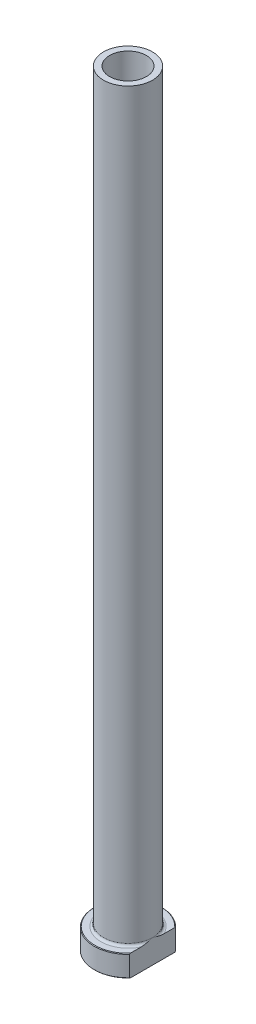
ISO-10303-21;
HEADER;
FILE_DESCRIPTION(('STEP AP214'),'2;1');
FILE_NAME('part.step','',(''),(''),'','','');
FILE_SCHEMA(('AUTOMOTIVE_DESIGN { 1 0 10303 214 1 1 1 1 }'));
ENDSEC;
DATA;
#1=APPLICATION_CONTEXT('core data for automotive mechanical design processes');
#2=APPLICATION_PROTOCOL_DEFINITION('international standard','automotive_design',2000,#1);
#3=PRODUCT_CONTEXT('',#1,'mechanical');
#4=PRODUCT('Part','Part','',(#3));
#5=PRODUCT_RELATED_PRODUCT_CATEGORY('part','',(#4));
#6=PRODUCT_DEFINITION_FORMATION('','',#4);
#7=PRODUCT_DEFINITION_CONTEXT('part definition',#1,'design');
#8=PRODUCT_DEFINITION('design','',#6,#7);
#9=PRODUCT_DEFINITION_SHAPE('','',#8);
#10=(LENGTH_UNIT() NAMED_UNIT(*) SI_UNIT(.MILLI.,.METRE.));
#11=(NAMED_UNIT(*) PLANE_ANGLE_UNIT() SI_UNIT($,.RADIAN.));
#12=(NAMED_UNIT(*) SI_UNIT($,.STERADIAN.) SOLID_ANGLE_UNIT());
#13=UNCERTAINTY_MEASURE_WITH_UNIT(LENGTH_MEASURE(1.E-05),#10,'distance_accuracy_value','');
#14=(GEOMETRIC_REPRESENTATION_CONTEXT(3) GLOBAL_UNCERTAINTY_ASSIGNED_CONTEXT((#13)) GLOBAL_UNIT_ASSIGNED_CONTEXT((#10,
#11,#12)) REPRESENTATION_CONTEXT('',''));
#15=CARTESIAN_POINT('',(0.,0.,0.));
#16=DIRECTION('',(0.,0.,1.));
#17=DIRECTION('',(1.,0.,0.));
#18=AXIS2_PLACEMENT_3D('',#15,#16,#17);
#19=CARTESIAN_POINT('',(0.,92.1876809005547,0.));
#20=DIRECTION('',(0.,1.,0.));
#21=DIRECTION('',(0.,0.,1.));
#22=AXIS2_PLACEMENT_3D('',#19,#20,#21);
#23=CYLINDRICAL_SURFACE('',#22,6.00000000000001);
#24=CARTESIAN_POINT('',(0.,250.,0.));
#25=DIRECTION('',(0.,1.,0.));
#26=DIRECTION('',(0.,0.,1.));
#27=AXIS2_PLACEMENT_3D('',#24,#25,#26);
#28=CIRCLE('',#27,6.00000000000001);
#29=CARTESIAN_POINT('',(0.,250.,6.00000000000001));
#30=VERTEX_POINT('',#29);
#31=EDGE_CURVE('E167',#30,#30,#28,.T.);
#32=ORIENTED_EDGE('',*,*,#31,.T.);
#33=EDGE_LOOP('',(#32));
#34=FACE_BOUND('',#33,.T.);
#35=CARTESIAN_POINT('',(0.,195.,0.));
#36=DIRECTION('',(0.,1.,0.));
#37=DIRECTION('',(0.,0.,1.));
#38=AXIS2_PLACEMENT_3D('',#35,#36,#37);
#39=CIRCLE('',#38,6.00000000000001);
#40=CARTESIAN_POINT('',(0.,195.,6.00000000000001));
#41=VERTEX_POINT('',#40);
#42=EDGE_CURVE('E170',#41,#41,#39,.T.);
#43=ORIENTED_EDGE('',*,*,#42,.F.);
#44=EDGE_LOOP('',(#43));
#45=FACE_BOUND('',#44,.T.);
#46=ADVANCED_FACE('F32',(#34,#45),#23,.F.);
#47=CARTESIAN_POINT('',(-6.00000000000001,250.,0.));
#48=DIRECTION('',(0.,1.,0.));
#49=DIRECTION('',(0.,0.,1.));
#50=AXIS2_PLACEMENT_3D('',#47,#48,#49);
#51=PLANE('',#50);
#52=CARTESIAN_POINT('',(0.,250.,0.));
#53=DIRECTION('',(0.,1.,0.));
#54=DIRECTION('',(0.,0.,1.));
#55=AXIS2_PLACEMENT_3D('',#52,#53,#54);
#56=CIRCLE('',#55,8.00000000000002);
#57=CARTESIAN_POINT('',(0.,250.,8.00000000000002));
#58=VERTEX_POINT('',#57);
#59=EDGE_CURVE('E174',#58,#58,#56,.T.);
#60=ORIENTED_EDGE('',*,*,#59,.T.);
#61=EDGE_LOOP('',(#60));
#62=FACE_BOUND('',#61,.T.);
#63=ORIENTED_EDGE('',*,*,#31,.F.);
#64=EDGE_LOOP('',(#63));
#65=FACE_BOUND('',#64,.T.);
#66=ADVANCED_FACE('F157',(#62,#65),#51,.T.);
#67=CARTESIAN_POINT('',(0.,92.1876809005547,0.));
#68=DIRECTION('',(0.,1.,0.));
#69=DIRECTION('',(0.,0.,1.));
#70=AXIS2_PLACEMENT_3D('',#67,#68,#69);
#71=CYLINDRICAL_SURFACE('',#70,8.);
#72=CARTESIAN_POINT('',(0.,7.8,0.));
#73=DIRECTION('',(0.,1.,0.));
#74=DIRECTION('',(0.,0.,1.));
#75=AXIS2_PLACEMENT_3D('',#72,#73,#74);
#76=CIRCLE('',#75,8.);
#77=CARTESIAN_POINT('',(8.,7.8,0.));
#78=VERTEX_POINT('',#77);
#79=EDGE_CURVE('E180',#78,#78,#76,.T.);
#80=ORIENTED_EDGE('',*,*,#79,.T.);
#81=EDGE_LOOP('',(#80));
#82=FACE_BOUND('',#81,.T.);
#83=ORIENTED_EDGE('',*,*,#59,.F.);
#84=EDGE_LOOP('',(#83));
#85=FACE_BOUND('',#84,.T.);
#86=ADVANCED_FACE('F162',(#82,#85),#71,.T.);
#87=CARTESIAN_POINT('',(-7.99999999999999,7.,0.));
#88=DIRECTION('',(0.,1.,0.));
#89=DIRECTION('',(0.,0.,1.));
#90=AXIS2_PLACEMENT_3D('',#87,#88,#89);
#91=PLANE('',#90);
#92=DIRECTION('',(0.,0.,1.));
#93=VECTOR('',#92,1.);
#94=CARTESIAN_POINT('',(8.,7.,0.));
#95=LINE('',#94,#93);
#96=CARTESIAN_POINT('',(8.,7.,-7.25534285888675));
#97=VERTEX_POINT('',#96);
#98=CARTESIAN_POINT('',(8.,7.,-3.66606055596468));
#99=VERTEX_POINT('',#98);
#100=EDGE_CURVE('E54',#97,#99,#95,.T.);
#101=ORIENTED_EDGE('',*,*,#100,.F.);
#102=CARTESIAN_POINT('',(0.,7.,0.));
#103=DIRECTION('',(0.,1.,0.));
#104=DIRECTION('',(0.,0.,1.));
#105=AXIS2_PLACEMENT_3D('',#102,#103,#104);
#106=CIRCLE('',#105,10.8);
#107=CARTESIAN_POINT('',(8.,7.,7.25534285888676));
#108=VERTEX_POINT('',#107);
#109=EDGE_CURVE('E186',#97,#108,#106,.T.);
#110=ORIENTED_EDGE('',*,*,#109,.T.);
#111=CARTESIAN_POINT('',(8.,7.,3.66606055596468));
#112=VERTEX_POINT('',#111);
#113=EDGE_CURVE('E134',#112,#108,#95,.T.);
#114=ORIENTED_EDGE('',*,*,#113,.F.);
#115=CARTESIAN_POINT('',(0.,7.,0.));
#116=DIRECTION('',(0.,1.,0.));
#117=DIRECTION('',(0.,0.,1.));
#118=AXIS2_PLACEMENT_3D('',#115,#116,#117);
#119=CIRCLE('',#118,8.8);
#120=EDGE_CURVE('E183',#112,#99,#119,.F.);
#121=ORIENTED_EDGE('',*,*,#120,.T.);
#122=EDGE_LOOP('',(#101,#110,#114,#121));
#123=FACE_BOUND('',#122,.T.);
#124=ADVANCED_FACE('F197',(#123),#91,.T.);
#125=CARTESIAN_POINT('',(0.,92.1876809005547,0.));
#126=DIRECTION('',(0.,1.,0.));
#127=DIRECTION('',(0.,0.,1.));
#128=AXIS2_PLACEMENT_3D('',#125,#126,#127);
#129=CYLINDRICAL_SURFACE('',#128,11.);
#130=DIRECTION('',(0.,-1.,0.));
#131=VECTOR('',#130,1.);
#132=CARTESIAN_POINT('',(8.,250.,7.54983443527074));
#133=LINE('',#132,#131);
#134=CARTESIAN_POINT('',(8.,6.79999999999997,7.54983443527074));
#135=VERTEX_POINT('',#134);
#136=CARTESIAN_POINT('',(8.,0.200000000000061,7.54983443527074));
#137=VERTEX_POINT('',#136);
#138=EDGE_CURVE('E82',#135,#137,#133,.T.);
#139=ORIENTED_EDGE('',*,*,#138,.F.);
#140=CARTESIAN_POINT('',(0.,6.79999999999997,0.));
#141=DIRECTION('',(0.,1.,0.));
#142=DIRECTION('',(0.,0.,1.));
#143=AXIS2_PLACEMENT_3D('',#140,#141,#142);
#144=CIRCLE('',#143,11.);
#145=CARTESIAN_POINT('',(8.,6.79999999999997,-7.54983443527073));
#146=VERTEX_POINT('',#145);
#147=EDGE_CURVE('E95',#135,#146,#144,.F.);
#148=ORIENTED_EDGE('',*,*,#147,.T.);
#149=DIRECTION('',(0.,-1.,0.));
#150=VECTOR('',#149,1.);
#151=CARTESIAN_POINT('',(8.,250.,-7.54983443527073));
#152=LINE('',#151,#150);
#153=CARTESIAN_POINT('',(8.,0.200000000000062,-7.54983443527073));
#154=VERTEX_POINT('',#153);
#155=EDGE_CURVE('E192',#146,#154,#152,.T.);
#156=ORIENTED_EDGE('',*,*,#155,.T.);
#157=CARTESIAN_POINT('',(0.,0.200000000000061,0.));
#158=DIRECTION('',(0.,-1.,0.));
#159=DIRECTION('',(0.,0.,-1.));
#160=AXIS2_PLACEMENT_3D('',#157,#158,#159);
#161=CIRCLE('',#160,11.);
#162=EDGE_CURVE('E98',#154,#137,#161,.F.);
#163=ORIENTED_EDGE('',*,*,#162,.T.);
#164=EDGE_LOOP('',(#139,#148,#156,#163));
#165=FACE_BOUND('',#164,.T.);
#166=ADVANCED_FACE('F190',(#165),#129,.T.);
#167=CARTESIAN_POINT('',(-11.,0.,0.));
#168=DIRECTION('',(0.,-1.,0.));
#169=DIRECTION('',(0.,0.,-1.));
#170=AXIS2_PLACEMENT_3D('',#167,#168,#169);
#171=PLANE('',#170);
#172=CARTESIAN_POINT('',(0.,0.,0.));
#173=DIRECTION('',(0.,-1.,0.));
#174=DIRECTION('',(0.,0.,-1.));
#175=AXIS2_PLACEMENT_3D('',#172,#173,#174);
#176=CIRCLE('',#175,6.74999999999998);
#177=CARTESIAN_POINT('',(0.,0.,-6.74999999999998));
#178=VERTEX_POINT('',#177);
#179=EDGE_CURVE('E40',#178,#178,#176,.F.);
#180=ORIENTED_EDGE('',*,*,#179,.T.);
#181=EDGE_LOOP('',(#180));
#182=FACE_BOUND('',#181,.T.);
#183=DIRECTION('',(0.,0.,-1.));
#184=VECTOR('',#183,1.);
#185=CARTESIAN_POINT('',(8.,0.,7.54983443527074));
#186=LINE('',#185,#184);
#187=CARTESIAN_POINT('',(8.,0.,7.25534285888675));
#188=VERTEX_POINT('',#187);
#189=CARTESIAN_POINT('',(8.,0.,-7.25534285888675));
#190=VERTEX_POINT('',#189);
#191=EDGE_CURVE('E47',#188,#190,#186,.T.);
#192=ORIENTED_EDGE('',*,*,#191,.F.);
#193=CARTESIAN_POINT('',(0.,0.,0.));
#194=DIRECTION('',(0.,-1.,0.));
#195=DIRECTION('',(0.,0.,-1.));
#196=AXIS2_PLACEMENT_3D('',#193,#194,#195);
#197=CIRCLE('',#196,10.7999999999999);
#198=EDGE_CURVE('E92',#188,#190,#197,.T.);
#199=ORIENTED_EDGE('',*,*,#198,.T.);
#200=EDGE_LOOP('',(#192,#199));
#201=FACE_BOUND('',#200,.T.);
#202=ADVANCED_FACE('F91',(#182,#201),#171,.T.);
#203=CARTESIAN_POINT('',(0.,92.1876809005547,0.));
#204=DIRECTION('',(0.,1.,0.));
#205=DIRECTION('',(0.,0.,1.));
#206=AXIS2_PLACEMENT_3D('',#203,#204,#205);
#207=CYLINDRICAL_SURFACE('',#206,6.25);
#208=CARTESIAN_POINT('',(0.,0.499999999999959,0.));
#209=DIRECTION('',(0.,-1.,0.));
#210=DIRECTION('',(0.,0.,-1.));
#211=AXIS2_PLACEMENT_3D('',#208,#209,#210);
#212=CIRCLE('',#211,6.25);
#213=CARTESIAN_POINT('',(0.,0.499999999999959,-6.25));
#214=VERTEX_POINT('',#213);
#215=EDGE_CURVE('E11',#214,#214,#212,.T.);
#216=ORIENTED_EDGE('',*,*,#215,.T.);
#217=EDGE_LOOP('',(#216));
#218=FACE_BOUND('',#217,.T.);
#219=CARTESIAN_POINT('',(0.,183.,0.));
#220=DIRECTION('',(0.,1.,0.));
#221=DIRECTION('',(0.,0.,1.));
#222=AXIS2_PLACEMENT_3D('',#219,#220,#221);
#223=CIRCLE('',#222,6.25000000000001);
#224=CARTESIAN_POINT('',(0.,183.,6.25000000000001));
#225=VERTEX_POINT('',#224);
#226=EDGE_CURVE('E172',#225,#225,#223,.T.);
#227=ORIENTED_EDGE('',*,*,#226,.T.);
#228=EDGE_LOOP('',(#227));
#229=FACE_BOUND('',#228,.T.);
#230=ADVANCED_FACE('F215',(#218,#229),#207,.F.);
#231=CARTESIAN_POINT('',(0.,183.,0.));
#232=DIRECTION('',(0.,-1.,0.));
#233=DIRECTION('',(0.,0.,-1.));
#234=AXIS2_PLACEMENT_3D('',#231,#232,#233);
#235=CONICAL_SURFACE('',#234,6.25000000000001,0.0208303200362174);
#236=ORIENTED_EDGE('',*,*,#42,.T.);
#237=EDGE_LOOP('',(#236));
#238=FACE_BOUND('',#237,.T.);
#239=ORIENTED_EDGE('',*,*,#226,.F.);
#240=EDGE_LOOP('',(#239));
#241=FACE_BOUND('',#240,.T.);
#242=ADVANCED_FACE('F111',(#238,#241),#235,.F.);
#243=CARTESIAN_POINT('',(0.,7.8,0.));
#244=DIRECTION('',(0.,1.,0.));
#245=DIRECTION('',(0.,0.,1.));
#246=AXIS2_PLACEMENT_3D('',#243,#244,#245);
#247=TOROIDAL_SURFACE('',#246,8.8,0.8);
#248=ORIENTED_EDGE('',*,*,#120,.F.);
#249=CARTESIAN_POINT('',(8.,7.8,0.));
#250=CARTESIAN_POINT('',(8.,7.80000101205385,-1.09663887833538E-10));
#251=CARTESIAN_POINT('',(8.,7.80000202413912,2.93324122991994E-07));
#252=CARTESIAN_POINT('',(8.,7.80000394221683,1.16283100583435E-06));
#253=CARTESIAN_POINT('',(8.,7.80000483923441,1.75365147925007E-06));
#254=CARTESIAN_POINT('',(8.,7.80000665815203,3.16446795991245E-06));
#255=CARTESIAN_POINT('',(8.,7.80000756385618,4.00549183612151E-06));
#256=CARTESIAN_POINT('',(8.,7.80000923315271,5.78347948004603E-06));
#257=CARTESIAN_POINT('',(8.,7.8000099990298,6.71842053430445E-06));
#258=CARTESIAN_POINT('',(8.,7.80001270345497,1.02037220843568E-05));
#259=CARTESIAN_POINT('',(8.,7.80001449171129,1.28740408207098E-05));
#260=CARTESIAN_POINT('',(8.,7.80001755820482,1.82727392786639E-05));
#261=CARTESIAN_POINT('',(8.,7.8000188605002,2.09881564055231E-05));
#262=CARTESIAN_POINT('',(8.,7.80002405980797,3.2064781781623E-05));
#263=CARTESIAN_POINT('',(8.,7.8000277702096,4.05225605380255E-05));
#264=CARTESIAN_POINT('',(8.,7.80003348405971,5.68037726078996E-05));
#265=CARTESIAN_POINT('',(8.,7.80003564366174,6.45728891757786E-05));
#266=CARTESIAN_POINT('',(8.,7.8000509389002,0.000121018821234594));
#267=CARTESIAN_POINT('',(8.,7.80006211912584,0.000170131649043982));
#268=CARTESIAN_POINT('',(8.,7.80011099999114,0.000362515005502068));
#269=CARTESIAN_POINT('',(8.,7.80015802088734,0.000503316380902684));
#270=CARTESIAN_POINT('',(8.,7.80033939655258,0.00105711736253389));
#271=CARTESIAN_POINT('',(8.,7.80046737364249,0.0014716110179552));
#272=CARTESIAN_POINT('',(8.,7.80097644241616,0.00310648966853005));
#273=CARTESIAN_POINT('',(8.,7.80136531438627,0.00432501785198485));
#274=CARTESIAN_POINT('',(8.,7.80297358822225,0.0093795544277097));
#275=CARTESIAN_POINT('',(8.,7.80418342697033,0.0132178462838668));
#276=CARTESIAN_POINT('',(7.99999999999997,7.82754122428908,0.0873020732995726));
#277=CARTESIAN_POINT('',(7.99999999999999,7.84979021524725,0.157524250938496));
#278=CARTESIAN_POINT('',(8.00000000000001,7.89322681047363,0.295235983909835));
#279=CARTESIAN_POINT('',(8.,7.91442151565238,0.362723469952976));
#280=CARTESIAN_POINT('',(8.,7.95923432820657,0.506178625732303));
#281=CARTESIAN_POINT('',(8.,7.98282525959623,0.58215493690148));
#282=CARTESIAN_POINT('',(8.,8.02983069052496,0.735069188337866));
#283=CARTESIAN_POINT('',(8.,8.05324046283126,0.812008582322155));
#284=CARTESIAN_POINT('',(8.,8.09303795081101,0.944645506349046));
#285=CARTESIAN_POINT('',(8.,8.10956807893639,1.00030022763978));
#286=CARTESIAN_POINT('',(8.,8.14221289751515,1.11157683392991));
#287=CARTESIAN_POINT('',(8.,8.15832854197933,1.16719843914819));
#288=CARTESIAN_POINT('',(8.,8.20527739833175,1.33164052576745));
#289=CARTESIAN_POINT('',(8.,8.23549814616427,1.44063711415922));
#290=CARTESIAN_POINT('',(8.,8.29826335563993,1.67606835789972));
#291=CARTESIAN_POINT('',(8.,8.33044741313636,1.80259995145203));
#292=CARTESIAN_POINT('',(8.,8.39126396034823,2.05750030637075));
#293=CARTESIAN_POINT('',(8.,8.41986879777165,2.18587573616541));
#294=CARTESIAN_POINT('',(8.,8.47414203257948,2.45321874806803));
#295=CARTESIAN_POINT('',(8.,8.49943375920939,2.59226394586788));
#296=CARTESIAN_POINT('',(8.,8.54278750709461,2.87150561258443));
#297=CARTESIAN_POINT('',(8.,8.56085024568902,3.01170196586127));
#298=CARTESIAN_POINT('',(8.,8.58291287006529,3.24319459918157));
#299=CARTESIAN_POINT('',(8.,8.58962750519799,3.33423069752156));
#300=CARTESIAN_POINT('',(8.,8.59844042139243,3.51651109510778));
#301=CARTESIAN_POINT('',(8.,8.60054027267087,3.60775531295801));
#302=CARTESIAN_POINT('',(8.,8.59923478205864,3.78855451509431));
#303=CARTESIAN_POINT('',(8.,8.59592927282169,3.87810991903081));
#304=CARTESIAN_POINT('',(8.,8.58288784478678,4.05671727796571));
#305=CARTESIAN_POINT('',(8.,8.5731571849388,4.14576958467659));
#306=CARTESIAN_POINT('',(8.,8.54786053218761,4.30910044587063));
#307=CARTESIAN_POINT('',(8.,8.53341905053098,4.38354919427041));
#308=CARTESIAN_POINT('',(8.,8.4974754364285,4.53120906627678));
#309=CARTESIAN_POINT('',(8.,8.47593618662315,4.60441150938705));
#310=CARTESIAN_POINT('',(8.,8.42376924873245,4.74853436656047));
#311=CARTESIAN_POINT('',(8.,8.39303920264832,4.8194185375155));
#312=CARTESIAN_POINT('',(8.,8.32008168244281,4.95490582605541));
#313=CARTESIAN_POINT('',(8.,8.27792970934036,5.01954653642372));
#314=CARTESIAN_POINT('',(8.,8.20692535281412,5.10354772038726));
#315=CARTESIAN_POINT('',(8.,8.1839783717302,5.12788591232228));
#316=CARTESIAN_POINT('',(8.,8.13503511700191,5.17336988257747));
#317=CARTESIAN_POINT('',(8.,8.10903727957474,5.19451401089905));
#318=CARTESIAN_POINT('',(8.,8.05362521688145,5.23266411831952));
#319=CARTESIAN_POINT('',(8.,8.02417247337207,5.2496152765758));
#320=CARTESIAN_POINT('',(8.,7.96255238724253,5.27751973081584));
#321=CARTESIAN_POINT('',(8.,7.93039220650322,5.28848831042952));
#322=CARTESIAN_POINT('',(8.,7.87282733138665,5.30129051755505));
#323=CARTESIAN_POINT('',(8.,7.84777777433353,5.30473535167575));
#324=CARTESIAN_POINT('',(8.,7.7974579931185,5.30730687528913));
#325=CARTESIAN_POINT('',(8.,7.77218785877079,5.30643524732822));
#326=CARTESIAN_POINT('',(8.,7.72220872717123,5.30045124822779));
#327=CARTESIAN_POINT('',(8.,7.69749884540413,5.29534612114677));
#328=CARTESIAN_POINT('',(8.,7.64919855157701,5.28130622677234));
#329=CARTESIAN_POINT('',(8.,7.62560888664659,5.27236894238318));
#330=CARTESIAN_POINT('',(8.,7.57186978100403,5.24749103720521));
#331=CARTESIAN_POINT('',(8.,7.54235117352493,5.23019143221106));
#332=CARTESIAN_POINT('',(8.,7.48647501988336,5.1910787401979));
#333=CARTESIAN_POINT('',(8.,7.46012476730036,5.16925554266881));
#334=CARTESIAN_POINT('',(8.,7.39758131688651,5.11005232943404));
#335=CARTESIAN_POINT('',(8.,7.36345256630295,5.07050732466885));
#336=CARTESIAN_POINT('',(8.,7.30158414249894,4.9868053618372));
#337=CARTESIAN_POINT('',(8.,7.27385227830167,4.9426428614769));
#338=CARTESIAN_POINT('',(8.,7.22655631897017,4.85651446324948));
#339=CARTESIAN_POINT('',(8.,7.20642608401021,4.81485346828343));
#340=CARTESIAN_POINT('',(8.,7.16979237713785,4.72995016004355));
#341=CARTESIAN_POINT('',(8.,7.15329194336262,4.6867065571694));
#342=CARTESIAN_POINT('',(8.,7.10824755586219,4.55471342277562));
#343=CARTESIAN_POINT('',(8.,7.08448205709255,4.46433285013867));
#344=CARTESIAN_POINT('',(8.,7.04606817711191,4.27884520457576));
#345=CARTESIAN_POINT('',(8.,7.03172934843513,4.18367881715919));
#346=CARTESIAN_POINT('',(8.,7.01115182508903,3.99231790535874));
#347=CARTESIAN_POINT('',(8.,7.004929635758,3.89612168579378));
#348=CARTESIAN_POINT('',(8.,6.99917472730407,3.70683203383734));
#349=CARTESIAN_POINT('',(8.,6.99942213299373,3.61374410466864));
#350=CARTESIAN_POINT('',(8.,7.00500334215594,3.42814181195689));
#351=CARTESIAN_POINT('',(8.,7.01031504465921,3.33562671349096));
#352=CARTESIAN_POINT('',(8.,7.027292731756,3.12465235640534));
#353=CARTESIAN_POINT('',(8.,7.04033732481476,3.00630616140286));
#354=CARTESIAN_POINT('',(8.,7.0720601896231,2.77043320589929));
#355=CARTESIAN_POINT('',(8.,7.09073668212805,2.65290619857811));
#356=CARTESIAN_POINT('',(8.,7.13314336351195,2.41598317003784));
#357=CARTESIAN_POINT('',(8.,7.15698005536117,2.29660645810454));
#358=CARTESIAN_POINT('',(8.,7.20856500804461,2.05839418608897));
#359=CARTESIAN_POINT('',(8.,7.23632304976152,1.9395607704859));
#360=CARTESIAN_POINT('',(8.,7.30538420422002,1.66026758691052));
#361=CARTESIAN_POINT('',(8.,7.34797978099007,1.50012949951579));
#362=CARTESIAN_POINT('',(8.,7.43661699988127,1.18271330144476));
#363=CARTESIAN_POINT('',(8.,7.48261587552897,1.02542306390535));
#364=CARTESIAN_POINT('',(8.,7.55073856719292,0.798945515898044));
#365=CARTESIAN_POINT('',(8.,7.57189590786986,0.729464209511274));
#366=CARTESIAN_POINT('',(8.,7.61466169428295,0.590318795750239));
#367=CARTESIAN_POINT('',(8.,7.63627166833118,0.520655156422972));
#368=CARTESIAN_POINT('',(8.,7.68075896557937,0.37807296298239));
#369=CARTESIAN_POINT('',(8.00000000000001,7.70364749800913,0.305157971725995));
#370=CARTESIAN_POINT('',(7.99999999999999,7.74926260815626,0.160522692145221));
#371=CARTESIAN_POINT('',(7.99999999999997,7.77198614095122,0.0888015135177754));
#372=CARTESIAN_POINT('',(8.,7.79581756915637,0.0132146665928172));
#373=CARTESIAN_POINT('',(8.,7.79702841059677,0.00937319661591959));
#374=CARTESIAN_POINT('',(8.,7.79863692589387,0.00431792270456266));
#375=CARTESIAN_POINT('',(8.,7.79902501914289,0.0031018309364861));
#376=CARTESIAN_POINT('',(8.,7.79953313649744,0.00147000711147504));
#377=CARTESIAN_POINT('',(8.,7.79966092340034,0.00105612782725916));
#378=CARTESIAN_POINT('',(8.,7.79984206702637,0.000503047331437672));
#379=CARTESIAN_POINT('',(8.,7.79988905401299,0.00036235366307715));
#380=CARTESIAN_POINT('',(8.,7.79993790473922,0.000170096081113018));
#381=CARTESIAN_POINT('',(8.,7.79994908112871,0.000120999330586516));
#382=CARTESIAN_POINT('',(8.,7.79996436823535,6.45695843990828E-05));
#383=CARTESIAN_POINT('',(8.,7.79996652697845,5.68014515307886E-05));
#384=CARTESIAN_POINT('',(8.,7.79997223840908,4.05221734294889E-05));
#385=CARTESIAN_POINT('',(8.,7.79997594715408,3.20652948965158E-05));
#386=CARTESIAN_POINT('',(8.,7.79998114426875,2.09895718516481E-05));
#387=CARTESIAN_POINT('',(8.,7.7999824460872,1.82742281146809E-05));
#388=CARTESIAN_POINT('',(8.,7.79998551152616,1.2875590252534E-05));
#389=CARTESIAN_POINT('',(8.,7.79998729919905,1.02052512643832E-05));
#390=CARTESIAN_POINT('',(8.,7.79999000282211,6.71981951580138E-06));
#391=CARTESIAN_POINT('',(8.,7.79999076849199,5.78481878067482E-06));
#392=CARTESIAN_POINT('',(8.,7.79999243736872,4.00667444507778E-06));
#393=CARTESIAN_POINT('',(8.,7.79999334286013,3.16555273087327E-06));
#394=CARTESIAN_POINT('',(8.,7.79999516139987,1.75450266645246E-06));
#395=CARTESIAN_POINT('',(8.,7.7999960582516,1.16355341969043E-06));
#396=CARTESIAN_POINT('',(8.,7.79999797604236,2.93728367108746E-07));
#397=CARTESIAN_POINT('',(8.,7.79999898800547,1.09661137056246E-10));
#398=CARTESIAN_POINT('',(8.,7.8,0.));
#399=B_SPLINE_CURVE_WITH_KNOTS('',3,(#249,#250,#251,#252,#253,#254,#255,#256,#257,#258,#259,
#260,#261,#262,#263,#264,#265,#266,#267,#268,#269,#270,#271,#272,#273,#274,#275,#276,#277,#278,
#279,#280,#281,#282,#283,#284,#285,#286,#287,#288,#289,#290,#291,#292,#293,#294,#295,#296,#297,
#298,#299,#300,#301,#302,#303,#304,#305,#306,#307,#308,#309,#310,#311,#312,#313,#314,#315,#316,
#317,#318,#319,#320,#321,#322,#323,#324,#325,#326,#327,#328,#329,#330,#331,#332,#333,#334,#335,
#336,#337,#338,#339,#340,#341,#342,#343,#344,#345,#346,#347,#348,#349,#350,#351,#352,#353,#354,
#355,#356,#357,#358,#359,#360,#361,#362,#363,#364,#365,#366,#367,#368,#369,#370,#371,#372,#373,
#374,#375,#376,#377,#378,#379,#380,#381,#382,#383,#384,#385,#386,#387,#388,#389,#390,#391,#392,
#393,#394,#395,#396,#397,#398),.UNSPECIFIED.,.T.,.F.,(4,2,2,2,2,2,2,2,2,2,2,2,2,2,2,2,2,2,2,2,2,
2,2,2,2,2,2,2,2,2,2,2,2,2,2,2,2,2,2,2,2,2,2,2,2,2,2,2,2,2,2,2,2,2,2,2,2,2,2,2,2,2,2,2,2,2,2,2,2,
2,2,2,2,2,4),(0.,3.04287455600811E-06,6.25419973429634E-06,9.94386247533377E-06,
1.35664308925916E-05,2.31665004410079E-05,3.21939784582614E-05,5.98353369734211E-05,
8.3994464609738E-05,0.000235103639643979,0.000679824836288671,0.00198183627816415,
0.00581831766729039,0.0178924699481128,0.238870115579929,0.451084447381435,0.689746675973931,
0.931010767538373,1.10518257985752,1.27890913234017,1.6182180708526,2.00985537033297,
2.40435266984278,2.82819297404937,3.25199120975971,3.5257483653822,3.79941235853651,
4.06807884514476,4.33652570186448,4.56378083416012,4.7922437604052,5.02335234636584,
5.25296903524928,5.35309534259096,5.45327319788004,5.55469877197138,5.65586400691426,
5.73137360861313,5.8068537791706,5.88220505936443,5.95760590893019,6.05967508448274,
6.16197489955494,6.31780492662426,6.47382418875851,6.61243130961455,6.75115400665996,
7.03070266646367,7.31902502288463,7.60793277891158,7.88703491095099,8.1649245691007,
8.52193605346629,8.87883486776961,9.24395493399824,9.61000233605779,10.107042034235,
10.5986476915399,10.8165407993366,11.0353545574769,11.2646261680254,11.4903206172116,
11.5024047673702,11.5062335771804,11.5075336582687,11.5079780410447,11.5081291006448,
11.5081532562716,11.5081808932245,11.5081899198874,11.5081995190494,11.5082031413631,
11.5082068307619,11.5082100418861,11.5082130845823),.UNSPECIFIED.);
#400=EDGE_CURVE('E126',#112,#78,#399,.T.);
#401=ORIENTED_EDGE('',*,*,#400,.T.);
#402=ORIENTED_EDGE('',*,*,#79,.F.);
#403=CARTESIAN_POINT('',(8.,7.8,0.));
#404=CARTESIAN_POINT('',(8.,7.79999898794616,1.09667807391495E-10));
#405=CARTESIAN_POINT('',(8.,7.79999797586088,-2.93324119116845E-07));
#406=CARTESIAN_POINT('',(8.,7.79999605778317,-1.16283100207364E-06));
#407=CARTESIAN_POINT('',(8.,7.79999516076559,-1.7536514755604E-06));
#408=CARTESIAN_POINT('',(8.,7.79999334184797,-3.16446795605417E-06));
#409=CARTESIAN_POINT('',(8.,7.79999243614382,-4.00549183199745E-06));
#410=CARTESIAN_POINT('',(8.,7.79999076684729,-5.78347947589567E-06));
#411=CARTESIAN_POINT('',(8.,7.7999900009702,-6.71842053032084E-06));
#412=CARTESIAN_POINT('',(8.,7.79998729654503,-1.02037220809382E-05));
#413=CARTESIAN_POINT('',(8.,7.79998550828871,-1.28740408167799E-05));
#414=CARTESIAN_POINT('',(8.,7.79998244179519,-1.82727392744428E-05));
#415=CARTESIAN_POINT('',(8.,7.7999811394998,-2.09881564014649E-05));
#416=CARTESIAN_POINT('',(8.,7.79997594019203,-3.20647817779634E-05));
#417=CARTESIAN_POINT('',(8.,7.7999722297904,-4.05225605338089E-05));
#418=CARTESIAN_POINT('',(8.,7.79996651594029,-5.68037726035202E-05));
#419=CARTESIAN_POINT('',(8.,7.79996435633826,-6.45728891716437E-05));
#420=CARTESIAN_POINT('',(8.,7.7999490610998,-0.00012101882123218));
#421=CARTESIAN_POINT('',(8.,7.79993788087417,-0.00017013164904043));
#422=CARTESIAN_POINT('',(8.,7.79988900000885,-0.000362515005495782));
#423=CARTESIAN_POINT('',(8.,7.79984197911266,-0.000503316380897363));
#424=CARTESIAN_POINT('',(8.,7.79966060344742,-0.00105711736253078));
#425=CARTESIAN_POINT('',(8.,7.79953262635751,-0.0014716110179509));
#426=CARTESIAN_POINT('',(8.,7.79902355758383,-0.0031064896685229));
#427=CARTESIAN_POINT('',(8.,7.79863468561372,-0.004325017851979));
#428=CARTESIAN_POINT('',(8.,7.79702641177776,-0.00937955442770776));
#429=CARTESIAN_POINT('',(8.,7.79581657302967,-0.0132178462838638));
#430=CARTESIAN_POINT('',(7.99999999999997,7.77245877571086,-0.0873020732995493));
#431=CARTESIAN_POINT('',(7.99999999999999,7.75020978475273,-0.157524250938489));
#432=CARTESIAN_POINT('',(8.00000000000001,7.70677318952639,-0.295235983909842));
#433=CARTESIAN_POINT('',(8.,7.68557848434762,-0.362723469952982));
#434=CARTESIAN_POINT('',(8.,7.64076567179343,-0.506178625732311));
#435=CARTESIAN_POINT('',(8.,7.61717474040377,-0.582154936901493));
#436=CARTESIAN_POINT('',(8.,7.57016930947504,-0.735069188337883));
#437=CARTESIAN_POINT('',(8.,7.54675953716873,-0.812008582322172));
#438=CARTESIAN_POINT('',(8.,7.50696204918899,-0.944645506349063));
#439=CARTESIAN_POINT('',(8.,7.4904319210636,-1.00030022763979));
#440=CARTESIAN_POINT('',(8.,7.45778710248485,-1.11157683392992));
#441=CARTESIAN_POINT('',(8.,7.44167145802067,-1.1671984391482));
#442=CARTESIAN_POINT('',(8.,7.39472260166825,-1.33164052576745));
#443=CARTESIAN_POINT('',(8.,7.36450185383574,-1.44063711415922));
#444=CARTESIAN_POINT('',(8.,7.30173664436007,-1.67606835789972));
#445=CARTESIAN_POINT('',(8.,7.26955258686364,-1.80259995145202));
#446=CARTESIAN_POINT('',(8.,7.20873603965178,-2.05750030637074));
#447=CARTESIAN_POINT('',(8.,7.18013120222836,-2.1858757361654));
#448=CARTESIAN_POINT('',(8.,7.12585796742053,-2.45321874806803));
#449=CARTESIAN_POINT('',(8.,7.10056624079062,-2.59226394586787));
#450=CARTESIAN_POINT('',(8.,7.0572124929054,-2.87150561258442));
#451=CARTESIAN_POINT('',(8.,7.03914975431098,-3.01170196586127));
#452=CARTESIAN_POINT('',(8.,7.01708712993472,-3.24319459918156));
#453=CARTESIAN_POINT('',(8.,7.01037249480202,-3.33423069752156));
#454=CARTESIAN_POINT('',(8.,7.00155957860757,-3.51651109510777));
#455=CARTESIAN_POINT('',(8.,6.99945972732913,-3.607755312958));
#456=CARTESIAN_POINT('',(8.,7.00076521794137,-3.7885545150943));
#457=CARTESIAN_POINT('',(8.,7.00407072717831,-3.8781099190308));
#458=CARTESIAN_POINT('',(8.,7.01711215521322,-4.0567172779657));
#459=CARTESIAN_POINT('',(8.,7.02684281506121,-4.14576958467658));
#460=CARTESIAN_POINT('',(8.,7.05213946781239,-4.30910044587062));
#461=CARTESIAN_POINT('',(8.,7.06658094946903,-4.3835491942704));
#462=CARTESIAN_POINT('',(8.,7.1025245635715,-4.53120906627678));
#463=CARTESIAN_POINT('',(8.,7.12406381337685,-4.60441150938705));
#464=CARTESIAN_POINT('',(8.,7.17623075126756,-4.74853436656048));
#465=CARTESIAN_POINT('',(8.,7.20696079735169,-4.8194185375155));
#466=CARTESIAN_POINT('',(8.,7.2799183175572,-4.95490582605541));
#467=CARTESIAN_POINT('',(8.,7.32207029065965,-5.01954653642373));
#468=CARTESIAN_POINT('',(8.,7.39307464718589,-5.10354772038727));
#469=CARTESIAN_POINT('',(8.,7.41602162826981,-5.12788591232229));
#470=CARTESIAN_POINT('',(8.,7.46496488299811,-5.17336988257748));
#471=CARTESIAN_POINT('',(8.,7.49096272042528,-5.19451401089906));
#472=CARTESIAN_POINT('',(8.,7.54637478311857,-5.23266411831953));
#473=CARTESIAN_POINT('',(8.,7.57582752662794,-5.24961527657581));
#474=CARTESIAN_POINT('',(8.,7.63744761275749,-5.27751973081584));
#475=CARTESIAN_POINT('',(8.,7.6696077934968,-5.28848831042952));
#476=CARTESIAN_POINT('',(8.,7.72717266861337,-5.30129051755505));
#477=CARTESIAN_POINT('',(8.,7.75222222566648,-5.30473535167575));
#478=CARTESIAN_POINT('',(8.,7.80254200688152,-5.30730687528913));
#479=CARTESIAN_POINT('',(8.,7.82781214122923,-5.30643524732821));
#480=CARTESIAN_POINT('',(8.,7.87779127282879,-5.30045124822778));
#481=CARTESIAN_POINT('',(8.,7.90250115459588,-5.29534612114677));
#482=CARTESIAN_POINT('',(8.,7.950801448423,-5.28130622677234));
#483=CARTESIAN_POINT('',(8.,7.97439111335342,-5.27236894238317));
#484=CARTESIAN_POINT('',(8.,8.02813021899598,-5.2474910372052));
#485=CARTESIAN_POINT('',(8.,8.05764882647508,-5.23019143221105));
#486=CARTESIAN_POINT('',(8.,8.11352498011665,-5.19107874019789));
#487=CARTESIAN_POINT('',(8.,8.13987523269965,-5.1692555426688));
#488=CARTESIAN_POINT('',(8.,8.20241868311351,-5.11005232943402));
#489=CARTESIAN_POINT('',(8.,8.23654743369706,-5.07050732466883));
#490=CARTESIAN_POINT('',(8.,8.29841585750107,-4.98680536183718));
#491=CARTESIAN_POINT('',(8.,8.32614772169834,-4.94264286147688));
#492=CARTESIAN_POINT('',(8.,8.37344368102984,-4.85651446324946));
#493=CARTESIAN_POINT('',(8.,8.3935739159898,-4.8148534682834));
#494=CARTESIAN_POINT('',(8.,8.43020762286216,-4.72995016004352));
#495=CARTESIAN_POINT('',(8.,8.44670805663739,-4.68670655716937));
#496=CARTESIAN_POINT('',(8.,8.49175244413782,-4.55471342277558));
#497=CARTESIAN_POINT('',(8.,8.51551794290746,-4.46433285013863));
#498=CARTESIAN_POINT('',(8.,8.5539318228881,-4.27884520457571));
#499=CARTESIAN_POINT('',(8.,8.56827065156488,-4.18367881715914));
#500=CARTESIAN_POINT('',(8.,8.58884817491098,-3.99231790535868));
#501=CARTESIAN_POINT('',(8.,8.59507036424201,-3.89612168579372));
#502=CARTESIAN_POINT('',(8.,8.60082527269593,-3.70683203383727));
#503=CARTESIAN_POINT('',(8.,8.60057786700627,-3.61374410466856));
#504=CARTESIAN_POINT('',(8.,8.59499665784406,-3.42814181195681));
#505=CARTESIAN_POINT('',(8.,8.58968495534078,-3.33562671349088));
#506=CARTESIAN_POINT('',(8.,8.57270726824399,-3.12465235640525));
#507=CARTESIAN_POINT('',(8.,8.55966267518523,-3.00630616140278));
#508=CARTESIAN_POINT('',(8.,8.52793981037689,-2.77043320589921));
#509=CARTESIAN_POINT('',(8.,8.50926331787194,-2.65290619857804));
#510=CARTESIAN_POINT('',(8.,8.46685663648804,-2.41598317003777));
#511=CARTESIAN_POINT('',(8.,8.44301994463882,-2.29660645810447));
#512=CARTESIAN_POINT('',(8.,8.39143499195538,-2.05839418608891));
#513=CARTESIAN_POINT('',(8.,8.36367695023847,-1.93956077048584));
#514=CARTESIAN_POINT('',(8.,8.29461579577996,-1.66026758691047));
#515=CARTESIAN_POINT('',(8.,8.25202021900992,-1.50012949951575));
#516=CARTESIAN_POINT('',(8.,8.16338300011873,-1.18271330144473));
#517=CARTESIAN_POINT('',(8.,8.11738412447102,-1.02542306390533));
#518=CARTESIAN_POINT('',(8.,8.04926143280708,-0.79894551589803));
#519=CARTESIAN_POINT('',(8.,8.02810409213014,-0.72946420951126));
#520=CARTESIAN_POINT('',(8.,7.98533830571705,-0.590318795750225));
#521=CARTESIAN_POINT('',(8.,7.96372833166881,-0.520655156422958));
#522=CARTESIAN_POINT('',(8.,7.91924103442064,-0.378072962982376));
#523=CARTESIAN_POINT('',(8.00000000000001,7.89635250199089,-0.305157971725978));
#524=CARTESIAN_POINT('',(7.99999999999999,7.85073739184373,-0.16052269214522));
#525=CARTESIAN_POINT('',(7.99999999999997,7.82801385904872,-0.088801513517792));
#526=CARTESIAN_POINT('',(8.,7.80418243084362,-0.0132146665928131));
#527=CARTESIAN_POINT('',(8.,7.80297158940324,-0.00937319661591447));
#528=CARTESIAN_POINT('',(8.,7.80136307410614,-0.00431792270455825));
#529=CARTESIAN_POINT('',(8.,7.80097498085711,-0.00310183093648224));
#530=CARTESIAN_POINT('',(8.,7.80046686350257,-0.00147000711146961));
#531=CARTESIAN_POINT('',(8.,7.80033907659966,-0.00105612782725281));
#532=CARTESIAN_POINT('',(8.,7.80015793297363,-0.000503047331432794));
#533=CARTESIAN_POINT('',(8.,7.80011094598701,-0.00036235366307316));
#534=CARTESIAN_POINT('',(8.,7.80006209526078,-0.000170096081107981));
#535=CARTESIAN_POINT('',(8.,7.80005091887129,-0.000120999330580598));
#536=CARTESIAN_POINT('',(8.,7.80003563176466,-6.45695843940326E-05));
#537=CARTESIAN_POINT('',(8.,7.80003347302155,-5.68014515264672E-05));
#538=CARTESIAN_POINT('',(8.,7.80002776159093,-4.05221734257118E-05));
#539=CARTESIAN_POINT('',(8.,7.80002405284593,-3.20652948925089E-05));
#540=CARTESIAN_POINT('',(8.,7.80001885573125,-2.09895718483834E-05));
#541=CARTESIAN_POINT('',(8.,7.80001755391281,-1.8274228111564E-05));
#542=CARTESIAN_POINT('',(8.,7.80001448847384,-1.28755902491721E-05));
#543=CARTESIAN_POINT('',(8.,7.80001270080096,-1.02052512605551E-05));
#544=CARTESIAN_POINT('',(8.,7.80000999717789,-6.71981951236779E-06));
#545=CARTESIAN_POINT('',(8.,7.80000923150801,-5.78481877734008E-06));
#546=CARTESIAN_POINT('',(8.,7.80000756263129,-4.00667444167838E-06));
#547=CARTESIAN_POINT('',(8.,7.80000665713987,-3.16555272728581E-06));
#548=CARTESIAN_POINT('',(8.,7.80000483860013,-1.75450266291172E-06));
#549=CARTESIAN_POINT('',(8.,7.8000039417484,-1.16355341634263E-06));
#550=CARTESIAN_POINT('',(8.,7.80000202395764,-2.93728363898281E-07));
#551=CARTESIAN_POINT('',(8.,7.80000101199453,-1.09657703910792E-10));
#552=CARTESIAN_POINT('',(8.,7.8,0.));
#553=B_SPLINE_CURVE_WITH_KNOTS('',3,(#403,#404,#405,#406,#407,#408,#409,#410,#411,#412,#413,
#414,#415,#416,#417,#418,#419,#420,#421,#422,#423,#424,#425,#426,#427,#428,#429,#430,#431,#432,
#433,#434,#435,#436,#437,#438,#439,#440,#441,#442,#443,#444,#445,#446,#447,#448,#449,#450,#451,
#452,#453,#454,#455,#456,#457,#458,#459,#460,#461,#462,#463,#464,#465,#466,#467,#468,#469,#470,
#471,#472,#473,#474,#475,#476,#477,#478,#479,#480,#481,#482,#483,#484,#485,#486,#487,#488,#489,
#490,#491,#492,#493,#494,#495,#496,#497,#498,#499,#500,#501,#502,#503,#504,#505,#506,#507,#508,
#509,#510,#511,#512,#513,#514,#515,#516,#517,#518,#519,#520,#521,#522,#523,#524,#525,#526,#527,
#528,#529,#530,#531,#532,#533,#534,#535,#536,#537,#538,#539,#540,#541,#542,#543,#544,#545,#546,
#547,#548,#549,#550,#551,#552),.UNSPECIFIED.,.T.,.F.,(4,2,2,2,2,2,2,2,2,2,2,2,2,2,2,2,2,2,2,2,2,
2,2,2,2,2,2,2,2,2,2,2,2,2,2,2,2,2,2,2,2,2,2,2,2,2,2,2,2,2,2,2,2,2,2,2,2,2,2,2,2,2,2,2,2,2,2,2,2,
2,2,2,2,2,4),(0.,3.04287455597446E-06,6.25419973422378E-06,9.94386247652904E-06,
1.35664308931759E-05,2.31665004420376E-05,3.21939784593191E-05,5.98353369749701E-05,
8.39944646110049E-05,0.000235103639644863,0.00067982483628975,0.00198183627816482,
0.00581831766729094,0.0178924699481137,0.238870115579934,0.451084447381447,0.689746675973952,
0.931010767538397,1.10518257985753,1.27890913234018,1.6182180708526,2.00985537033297,
2.40435266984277,2.82819297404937,3.25199120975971,3.5257483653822,3.79941235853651,
4.06807884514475,4.33652570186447,4.56378083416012,4.7922437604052,5.02335234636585,
5.2529690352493,5.35309534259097,5.45327319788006,5.55469877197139,5.65586400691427,
5.73137360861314,5.80685377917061,5.88220505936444,5.9576059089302,6.05967508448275,
6.16197489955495,6.31780492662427,6.47382418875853,6.61243130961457,6.75115400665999,
7.03070266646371,7.31902502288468,7.60793277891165,7.88703491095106,8.16492456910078,
8.52193605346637,8.87883486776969,9.2439549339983,9.61000233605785,10.1070420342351,
10.5986476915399,10.8165407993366,11.0353545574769,11.2646261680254,11.4903206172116,
11.5024047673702,11.5062335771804,11.5075336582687,11.5079780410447,11.5081291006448,
11.5081532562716,11.5081808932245,11.5081899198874,11.5081995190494,11.5082031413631,
11.5082068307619,11.5082100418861,11.5082130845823),.UNSPECIFIED.);
#554=EDGE_CURVE('E135',#78,#99,#553,.T.);
#555=ORIENTED_EDGE('',*,*,#554,.T.);
#556=EDGE_LOOP('',(#248,#401,#402,#555));
#557=FACE_BOUND('',#556,.T.);
#558=ADVANCED_FACE('F141',(#557),#247,.F.);
#559=CARTESIAN_POINT('',(0.,7.00000000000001,0.));
#560=DIRECTION('',(0.,-1.,0.));
#561=DIRECTION('',(0.,0.,-1.));
#562=AXIS2_PLACEMENT_3D('',#559,#560,#561);
#563=CONICAL_SURFACE('',#562,10.7999999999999,0.785398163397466);
#564=CARTESIAN_POINT('',(8.,-0.636730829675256,-16.6106304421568));
#565=CARTESIAN_POINT('',(8.,-0.418611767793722,-16.3685283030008));
#566=CARTESIAN_POINT('',(8.,-0.200984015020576,-16.125984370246));
#567=CARTESIAN_POINT('',(8.,0.233148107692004,-15.6398927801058));
#568=CARTESIAN_POINT('',(8.,0.449652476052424,-15.3963451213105));
#569=CARTESIAN_POINT('',(8.,1.09739989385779,-14.6638687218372));
#570=CARTESIAN_POINT('',(8.,1.52674426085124,-14.1732538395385));
#571=CARTESIAN_POINT('',(8.,2.16792810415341,-13.4304656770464));
#572=CARTESIAN_POINT('',(8.,2.38226067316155,-13.1804430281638));
#573=CARTESIAN_POINT('',(8.,2.8089295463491,-12.6787083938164));
#574=CARTESIAN_POINT('',(8.,3.02126589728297,-12.4269964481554));
#575=CARTESIAN_POINT('',(8.,3.44357020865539,-11.9216744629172));
#576=CARTESIAN_POINT('',(8.,3.65353861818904,-11.6680647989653));
#577=CARTESIAN_POINT('',(8.,4.07074862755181,-11.1585723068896));
#578=CARTESIAN_POINT('',(8.,4.27798998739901,-10.9026892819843));
#579=CARTESIAN_POINT('',(8.,4.66965190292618,-10.4127607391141));
#580=CARTESIAN_POINT('',(8.,4.85436868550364,-10.1789522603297));
#581=CARTESIAN_POINT('',(8.,5.22063517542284,-9.70886883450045));
#582=CARTESIAN_POINT('',(8.,5.40218492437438,-9.47259391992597));
#583=CARTESIAN_POINT('',(8.,5.76149237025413,-8.99721569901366));
#584=CARTESIAN_POINT('',(8.,5.93925050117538,-8.75811272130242));
#585=CARTESIAN_POINT('',(8.,6.29022306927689,-8.27660199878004));
#586=CARTESIAN_POINT('',(8.,6.4634376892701,-8.03419438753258));
#587=CARTESIAN_POINT('',(8.,6.80398487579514,-7.54604999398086));
#588=CARTESIAN_POINT('',(8.,6.97132935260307,-7.30032154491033));
#589=CARTESIAN_POINT('',(8.,7.29928849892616,-6.80437777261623));
#590=CARTESIAN_POINT('',(8.,7.45990280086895,-6.55416220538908));
#591=CARTESIAN_POINT('',(8.,7.77264940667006,-6.04873149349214));
#592=CARTESIAN_POINT('',(8.,7.92478824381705,-5.7935204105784));
#593=CARTESIAN_POINT('',(8.,8.21859570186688,-5.27715744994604));
#594=CARTESIAN_POINT('',(8.,8.36026610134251,-5.0160065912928));
#595=CARTESIAN_POINT('',(8.,8.62213596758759,-4.50319242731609));
#596=CARTESIAN_POINT('',(8.,8.74311989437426,-4.25193242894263));
#597=CARTESIAN_POINT('',(8.,8.97065709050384,-3.74287674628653));
#598=CARTESIAN_POINT('',(8.,9.07720941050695,-3.48508063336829));
#599=CARTESIAN_POINT('',(8.,9.27220860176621,-2.96337495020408));
#600=CARTESIAN_POINT('',(8.,9.36069936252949,-2.69948197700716));
#601=CARTESIAN_POINT('',(8.,9.51604316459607,-2.16542713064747));
#602=CARTESIAN_POINT('',(8.,9.58290677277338,-1.89526838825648));
#603=CARTESIAN_POINT('',(8.,9.68291221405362,-1.39216000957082));
#604=CARTESIAN_POINT('',(8.,9.71967474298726,-1.15993430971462));
#605=CARTESIAN_POINT('',(8.,9.77336730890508,-0.693196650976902));
#606=CARTESIAN_POINT('',(8.,9.79030037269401,-0.458685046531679));
#607=CARTESIAN_POINT('',(8.,9.80342851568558,0.010672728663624));
#608=CARTESIAN_POINT('',(8.,9.79964609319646,0.245518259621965));
#609=CARTESIAN_POINT('',(8.,9.77160926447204,0.713989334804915));
#610=CARTESIAN_POINT('',(8.,9.74735189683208,0.947614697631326));
#611=CARTESIAN_POINT('',(8.,9.670708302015,1.47287443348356));
#612=CARTESIAN_POINT('',(8.,9.61261890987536,1.76367634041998));
#613=CARTESIAN_POINT('',(8.,9.46982192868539,2.33873282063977));
#614=CARTESIAN_POINT('',(8.,9.38509750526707,2.6229831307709));
#615=CARTESIAN_POINT('',(8.,9.24134311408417,3.0443685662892));
#616=CARTESIAN_POINT('',(8.,9.19048552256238,3.18437323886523));
#617=CARTESIAN_POINT('',(8.,9.08381674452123,3.46241560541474));
#618=CARTESIAN_POINT('',(8.,9.02800782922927,3.60045416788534));
#619=CARTESIAN_POINT('',(8.,8.91195481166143,3.87463242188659));
#620=CARTESIAN_POINT('',(8.,8.85171106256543,4.0107722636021));
#621=CARTESIAN_POINT('',(8.,8.72725899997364,4.28124317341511));
#622=CARTESIAN_POINT('',(8.,8.66305017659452,4.41557400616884));
#623=CARTESIAN_POINT('',(8.,8.4898473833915,4.76597692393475));
#624=CARTESIAN_POINT('',(8.,8.37796178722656,4.98062176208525));
#625=CARTESIAN_POINT('',(8.,8.14649205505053,5.40573762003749));
#626=CARTESIAN_POINT('',(8.,8.02690659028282,5.61620791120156));
#627=CARTESIAN_POINT('',(8.,7.78128707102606,6.03349586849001));
#628=CARTESIAN_POINT('',(8.,7.65524949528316,6.24031145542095));
#629=CARTESIAN_POINT('',(8.,7.39783636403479,6.65060320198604));
#630=CARTESIAN_POINT('',(8.,7.26646042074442,6.85407911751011));
#631=CARTESIAN_POINT('',(8.,6.99890352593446,7.25856399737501));
#632=CARTESIAN_POINT('',(8.,6.86271149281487,7.45956561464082));
#633=CARTESIAN_POINT('',(8.,6.58651908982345,7.85893907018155));
#634=CARTESIAN_POINT('',(8.,6.44651858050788,8.05731081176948));
#635=CARTESIAN_POINT('',(8.,6.0217824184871,8.64881247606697));
#636=CARTESIAN_POINT('',(8.,5.73221467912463,9.03847436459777));
#637=CARTESIAN_POINT('',(8.,5.14234581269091,9.81218500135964));
#638=CARTESIAN_POINT('',(8.,4.84200393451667,10.1962024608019));
#639=CARTESIAN_POINT('',(8.,4.234048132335,10.9584616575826));
#640=CARTESIAN_POINT('',(7.99999999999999,3.92643376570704,11.3367030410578));
#641=CARTESIAN_POINT('',(7.99999999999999,3.3060074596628,12.0880358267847));
#642=CARTESIAN_POINT('',(7.99999999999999,2.99320302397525,12.4611334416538));
#643=CARTESIAN_POINT('',(7.99999999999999,2.36317801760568,13.2035599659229));
#644=CARTESIAN_POINT('',(7.99999999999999,2.0459575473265,13.5728889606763));
#645=CARTESIAN_POINT('',(7.99999999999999,1.33644011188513,14.3909378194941));
#646=CARTESIAN_POINT('',(7.99999999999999,0.943258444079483,14.8388897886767));
#647=CARTESIAN_POINT('',(7.99999999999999,0.351483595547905,15.5068127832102));
#648=CARTESIAN_POINT('',(7.99999999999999,0.154449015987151,15.7281687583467));
#649=CARTESIAN_POINT('',(7.99999999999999,-0.240498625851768,16.1700151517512));
#650=CARTESIAN_POINT('',(7.99999999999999,-0.438411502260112,16.3905057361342));
#651=CARTESIAN_POINT('',(7.99999999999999,-0.636730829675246,16.6106304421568));
#652=B_SPLINE_CURVE_WITH_KNOTS('',3,(#564,#565,#566,#567,#568,#569,#570,#571,#572,#573,#574,
#575,#576,#577,#578,#579,#580,#581,#582,#583,#584,#585,#586,#587,#588,#589,#590,#591,#592,#593,
#594,#595,#596,#597,#598,#599,#600,#601,#602,#603,#604,#605,#606,#607,#608,#609,#610,#611,#612,
#613,#614,#615,#616,#617,#618,#619,#620,#621,#622,#623,#624,#625,#626,#627,#628,#629,#630,#631,
#632,#633,#634,#635,#636,#637,#638,#639,#640,#641,#642,#643,#644,#645,#646,#647,#648,#649,#650,
#651),.UNSPECIFIED.,.F.,.F.,(4,2,2,2,2,2,2,2,2,2,2,2,2,2,2,2,2,2,2,2,2,2,2,2,2,2,2,2,2,2,2,2,2,
2,2,2,2,2,2,2,2,2,2,4),(0.,0.97759892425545,1.95519922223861,3.91099512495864,4.89893858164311,
5.88685884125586,6.87458847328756,7.86240445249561,8.75629469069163,9.65017317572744,
10.543948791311,11.4376883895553,12.3294952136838,13.2213506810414,14.1125088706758,
15.0035153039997,15.8397621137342,16.676063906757,17.5103086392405,18.3441451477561,
19.0487229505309,19.7531931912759,20.456898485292,21.1607055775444,22.0488428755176,
22.9375426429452,23.3843335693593,23.8309205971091,24.2774720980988,24.7240811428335,
25.4500411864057,26.1761268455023,26.9026130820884,27.6291521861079,28.3574884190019,
29.085851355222,30.542052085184,32.0045059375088,33.4670490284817,34.927635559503,
36.3881889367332,38.176245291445,39.0652821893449,39.9541391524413),.UNSPECIFIED.);
#653=EDGE_CURVE('E133',#146,#97,#652,.T.);
#654=ORIENTED_EDGE('',*,*,#653,.F.);
#655=ORIENTED_EDGE('',*,*,#147,.F.);
#656=EDGE_CURVE('E118',#108,#135,#652,.T.);
#657=ORIENTED_EDGE('',*,*,#656,.F.);
#658=ORIENTED_EDGE('',*,*,#109,.F.);
#659=EDGE_LOOP('',(#654,#655,#657,#658));
#660=FACE_BOUND('',#659,.T.);
#661=ADVANCED_FACE('F145',(#660),#563,.T.);
#662=CARTESIAN_POINT('',(0.,0.200000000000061,0.));
#663=DIRECTION('',(0.,1.,0.));
#664=DIRECTION('',(0.,0.,1.));
#665=AXIS2_PLACEMENT_3D('',#662,#663,#664);
#666=CONICAL_SURFACE('',#665,11.,0.785398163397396);
#667=CARTESIAN_POINT('',(7.99999999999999,7.63673082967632,16.6106304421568));
#668=CARTESIAN_POINT('',(7.99999999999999,7.41861176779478,16.3685283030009));
#669=CARTESIAN_POINT('',(7.99999999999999,7.20098401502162,16.1259843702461));
#670=CARTESIAN_POINT('',(7.99999999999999,6.76685189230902,15.6398927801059));
#671=CARTESIAN_POINT('',(7.99999999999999,6.55034752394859,15.3963451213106));
#672=CARTESIAN_POINT('',(7.99999999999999,5.90260010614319,14.6638687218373));
#673=CARTESIAN_POINT('',(7.99999999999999,5.47325573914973,14.1732538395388));
#674=CARTESIAN_POINT('',(7.99999999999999,4.83207189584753,13.4304656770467));
#675=CARTESIAN_POINT('',(7.99999999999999,4.61773932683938,13.1804430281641));
#676=CARTESIAN_POINT('',(7.99999999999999,4.19107045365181,12.6787083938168));
#677=CARTESIAN_POINT('',(7.99999999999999,3.97873410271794,12.4269964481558));
#678=CARTESIAN_POINT('',(7.99999999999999,3.5564297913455,11.9216744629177));
#679=CARTESIAN_POINT('',(7.99999999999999,3.34646138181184,11.6680647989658));
#680=CARTESIAN_POINT('',(7.99999999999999,2.92925137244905,11.1585723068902));
#681=CARTESIAN_POINT('',(8.,2.72201001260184,10.9026892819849));
#682=CARTESIAN_POINT('',(8.,2.33034809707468,10.4127607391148));
#683=CARTESIAN_POINT('',(8.,2.14563131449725,10.1789522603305));
#684=CARTESIAN_POINT('',(8.,1.77936482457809,9.70886883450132));
#685=CARTESIAN_POINT('',(8.,1.59781507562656,9.4725939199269));
#686=CARTESIAN_POINT('',(8.,1.23850762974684,8.99721569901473));
#687=CARTESIAN_POINT('',(8.,1.06074949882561,8.75811272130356));
#688=CARTESIAN_POINT('',(8.,0.709776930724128,8.27660199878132));
#689=CARTESIAN_POINT('',(8.,0.536562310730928,8.03419438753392));
#690=CARTESIAN_POINT('',(8.,0.19601512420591,7.54604999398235));
#691=CARTESIAN_POINT('',(8.,0.0286706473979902,7.30032154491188));
#692=CARTESIAN_POINT('',(8.,-0.299288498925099,6.80437777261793));
#693=CARTESIAN_POINT('',(8.,-0.459902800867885,6.55416220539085));
#694=CARTESIAN_POINT('',(8.,-0.772649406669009,6.04873149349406));
#695=CARTESIAN_POINT('',(8.,-0.924788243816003,5.7935204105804));
#696=CARTESIAN_POINT('',(8.,-1.21859570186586,5.27715744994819));
#697=CARTESIAN_POINT('',(8.,-1.36026610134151,5.01600659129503));
#698=CARTESIAN_POINT('',(8.,-1.62213596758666,4.50319242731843));
#699=CARTESIAN_POINT('',(8.,-1.74311989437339,4.25193242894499));
#700=CARTESIAN_POINT('',(8.,-1.97065709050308,3.74287674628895));
#701=CARTESIAN_POINT('',(8.,-2.07720941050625,3.48508063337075));
#702=CARTESIAN_POINT('',(8.,-2.27220860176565,2.96337495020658));
#703=CARTESIAN_POINT('',(8.,-2.360699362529,2.6994819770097));
#704=CARTESIAN_POINT('',(8.,-2.51604316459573,2.16542713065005));
#705=CARTESIAN_POINT('',(8.,-2.58290677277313,1.89526838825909));
#706=CARTESIAN_POINT('',(8.,-2.68291221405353,1.39216000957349));
#707=CARTESIAN_POINT('',(8.,-2.71967474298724,1.15993430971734));
#708=CARTESIAN_POINT('',(8.,-2.77336730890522,0.693196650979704));
#709=CARTESIAN_POINT('',(8.,-2.79030037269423,0.458685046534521));
#710=CARTESIAN_POINT('',(8.,-2.80342851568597,-0.0106727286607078));
#711=CARTESIAN_POINT('',(8.,-2.79964609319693,-0.245518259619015));
#712=CARTESIAN_POINT('',(8.,-2.77160926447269,-0.713989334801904));
#713=CARTESIAN_POINT('',(8.,-2.74735189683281,-0.947614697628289));
#714=CARTESIAN_POINT('',(8.,-2.67070830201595,-1.47287443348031));
#715=CARTESIAN_POINT('',(8.,-2.61261890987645,-1.76367634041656));
#716=CARTESIAN_POINT('',(8.,-2.46982192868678,-2.33873282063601));
#717=CARTESIAN_POINT('',(8.,-2.38509750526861,-2.62298313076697));
#718=CARTESIAN_POINT('',(8.,-2.24134311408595,-3.04436856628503));
#719=CARTESIAN_POINT('',(8.,-2.19048552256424,-3.18437323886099));
#720=CARTESIAN_POINT('',(8.,-2.08381674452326,-3.46241560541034));
#721=CARTESIAN_POINT('',(8.,-2.02800782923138,-3.60045416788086));
#722=CARTESIAN_POINT('',(8.,-1.9119548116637,-3.87463242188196));
#723=CARTESIAN_POINT('',(8.,-1.85171106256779,-4.01077226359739));
#724=CARTESIAN_POINT('',(8.,-1.72725899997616,-4.28124317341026));
#725=CARTESIAN_POINT('',(8.,-1.66305017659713,-4.41557400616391));
#726=CARTESIAN_POINT('',(8.,-1.48984738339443,-4.76597692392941));
#727=CARTESIAN_POINT('',(8.,-1.37796178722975,-4.98062176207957));
#728=CARTESIAN_POINT('',(8.,-1.14649205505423,-5.40573762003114));
#729=CARTESIAN_POINT('',(8.,-1.02690659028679,-5.61620791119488));
#730=CARTESIAN_POINT('',(8.,-0.781287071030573,-6.03349586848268));
#731=CARTESIAN_POINT('',(8.,-0.655249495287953,-6.24031145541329));
#732=CARTESIAN_POINT('',(8.,-0.39783636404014,-6.65060320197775));
#733=CARTESIAN_POINT('',(8.,-0.266460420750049,-6.8540791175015));
#734=CARTESIAN_POINT('',(8.,0.00109647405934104,-7.25856399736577));
#735=CARTESIAN_POINT('',(8.,0.13728850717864,-7.45956561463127));
#736=CARTESIAN_POINT('',(8.,0.413480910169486,-7.85893907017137));
#737=CARTESIAN_POINT('',(8.,0.553481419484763,-8.05731081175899));
#738=CARTESIAN_POINT('',(8.,0.978217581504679,-8.64881247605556));
#739=CARTESIAN_POINT('',(8.,1.26778532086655,-9.03847436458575));
#740=CARTESIAN_POINT('',(8.,1.85765418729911,-9.81218500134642));
#741=CARTESIAN_POINT('',(8.,2.15799606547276,-10.1962024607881));
#742=CARTESIAN_POINT('',(8.,2.76595186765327,-10.9584616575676));
#743=CARTESIAN_POINT('',(8.,3.07356623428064,-11.3367030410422));
#744=CARTESIAN_POINT('',(8.,3.69399254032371,-12.0880358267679));
#745=CARTESIAN_POINT('',(8.,4.00679697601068,-12.4611334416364));
#746=CARTESIAN_POINT('',(8.,4.63682198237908,-13.2035599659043));
#747=CARTESIAN_POINT('',(8.,4.95404245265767,-13.5728889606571));
#748=CARTESIAN_POINT('',(8.,5.66355988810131,-14.3909378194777));
#749=CARTESIAN_POINT('',(8.,6.05674155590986,-14.8388897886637));
#750=CARTESIAN_POINT('',(8.,6.64851640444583,-15.5068127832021));
#751=CARTESIAN_POINT('',(8.,6.84555098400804,-15.7281687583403));
#752=CARTESIAN_POINT('',(8.,7.24049862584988,-16.1700151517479));
#753=CARTESIAN_POINT('',(8.,7.4384115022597,-16.3905057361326));
#754=CARTESIAN_POINT('',(8.,7.63673082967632,-16.6106304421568));
#755=B_SPLINE_CURVE_WITH_KNOTS('',3,(#667,#668,#669,#670,#671,#672,#673,#674,#675,#676,#677,
#678,#679,#680,#681,#682,#683,#684,#685,#686,#687,#688,#689,#690,#691,#692,#693,#694,#695,#696,
#697,#698,#699,#700,#701,#702,#703,#704,#705,#706,#707,#708,#709,#710,#711,#712,#713,#714,#715,
#716,#717,#718,#719,#720,#721,#722,#723,#724,#725,#726,#727,#728,#729,#730,#731,#732,#733,#734,
#735,#736,#737,#738,#739,#740,#741,#742,#743,#744,#745,#746,#747,#748,#749,#750,#751,#752,#753,
#754),.UNSPECIFIED.,.F.,.F.,(4,2,2,2,2,2,2,2,2,2,2,2,2,2,2,2,2,2,2,2,2,2,2,2,2,2,2,2,2,2,2,2,2,
2,2,2,2,2,2,2,2,2,2,4),(0.,0.977598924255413,1.95519922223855,3.91099512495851,4.89893858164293,
5.88685884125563,6.87458847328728,7.86240445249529,8.75629469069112,9.65017317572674,
10.5439487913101,11.4376883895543,12.3294952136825,13.2213506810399,14.1125088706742,
15.0035153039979,15.8397621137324,16.6760639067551,17.5103086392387,18.3441451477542,
19.048722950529,19.7531931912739,20.4568984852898,21.1607055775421,22.0488428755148,
22.9375426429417,23.3843335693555,23.830920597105,24.2774720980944,24.7240811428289,
25.4500411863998,26.1761268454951,26.90261308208,27.6291521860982,28.3574884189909,
29.0858513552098,30.5420520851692,32.0045059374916,33.4670490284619,34.9276355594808,
36.3881889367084,38.1762452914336,39.0652821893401,39.9541391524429),.UNSPECIFIED.);
#756=EDGE_CURVE('E79',#137,#188,#755,.T.);
#757=ORIENTED_EDGE('',*,*,#756,.F.);
#758=ORIENTED_EDGE('',*,*,#162,.F.);
#759=EDGE_CURVE('E87',#190,#154,#755,.T.);
#760=ORIENTED_EDGE('',*,*,#759,.F.);
#761=ORIENTED_EDGE('',*,*,#198,.F.);
#762=EDGE_LOOP('',(#757,#758,#760,#761));
#763=FACE_BOUND('',#762,.T.);
#764=ADVANCED_FACE('F94',(#763),#666,.T.);
#765=CARTESIAN_POINT('',(8.,250.,7.54983443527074));
#766=DIRECTION('',(-1.,0.,0.));
#767=DIRECTION('',(0.,0.,1.));
#768=AXIS2_PLACEMENT_3D('',#765,#766,#767);
#769=PLANE('',#768);
#770=ORIENTED_EDGE('',*,*,#400,.F.);
#771=ORIENTED_EDGE('',*,*,#113,.T.);
#772=ORIENTED_EDGE('',*,*,#656,.T.);
#773=ORIENTED_EDGE('',*,*,#138,.T.);
#774=ORIENTED_EDGE('',*,*,#756,.T.);
#775=ORIENTED_EDGE('',*,*,#191,.T.);
#776=ORIENTED_EDGE('',*,*,#759,.T.);
#777=ORIENTED_EDGE('',*,*,#155,.F.);
#778=ORIENTED_EDGE('',*,*,#653,.T.);
#779=ORIENTED_EDGE('',*,*,#100,.T.);
#780=ORIENTED_EDGE('',*,*,#554,.F.);
#781=EDGE_LOOP('',(#770,#771,#772,#773,#774,#775,#776,#777,#778,#779,#780));
#782=FACE_BOUND('',#781,.T.);
#783=ADVANCED_FACE('F80',(#782),#769,.F.);
#784=CARTESIAN_POINT('',(0.,0.,0.));
#785=DIRECTION('',(0.,-1.,0.));
#786=DIRECTION('',(0.,0.,-1.));
#787=AXIS2_PLACEMENT_3D('',#784,#785,#786);
#788=CONICAL_SURFACE('',#787,6.74999999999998,0.785398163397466);
#789=ORIENTED_EDGE('',*,*,#215,.F.);
#790=EDGE_LOOP('',(#789));
#791=FACE_BOUND('',#790,.T.);
#792=ORIENTED_EDGE('',*,*,#179,.F.);
#793=EDGE_LOOP('',(#792));
#794=FACE_BOUND('',#793,.T.);
#795=ADVANCED_FACE('F34',(#791,#794),#788,.F.);
#796=CLOSED_SHELL('',(#46,#66,#86,#124,#166,#202,#230,#242,#558,#661,#764,#783,#795));
#797=MANIFOLD_SOLID_BREP('B2',#796);
#798=ADVANCED_BREP_SHAPE_REPRESENTATION('',(#18,#797),#14);
#799=SHAPE_DEFINITION_REPRESENTATION(#9,#798);
ENDSEC;
END-ISO-10303-21;
